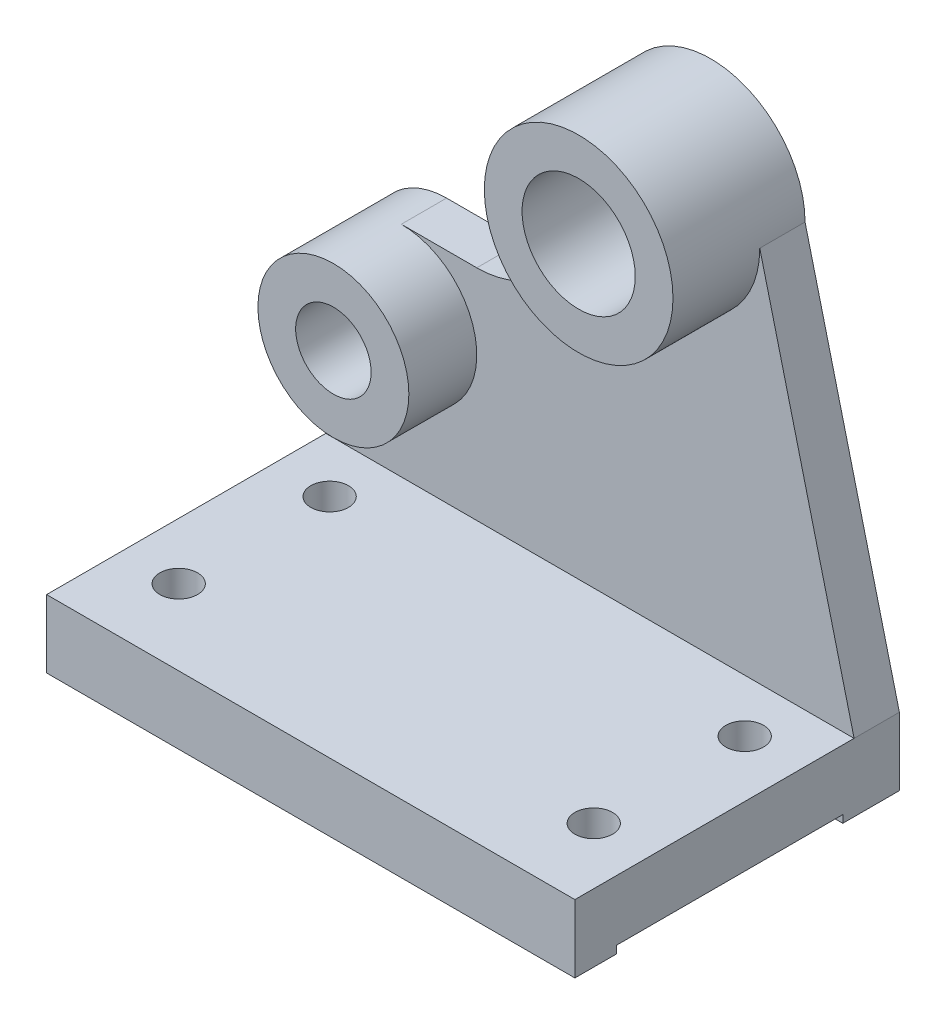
from build123d import *

# Parameters (mm, degrees)
SKETCH1_W           = 140
SKETCH1_H           = 18
BOSS_EXTRUDE1_DEPTH = 86
BOSS_EXTRUDE2_DEPTH = 12
SKETCH1_4_R         = 25
SKETCH1_4_R_2       = 15
BOSS_EXTRUDE3_DEPTH = 35
SKETCH1_5_R         = 20
SKETCH1_5_R_2       = 10
BOSS_EXTRUDE4_DEPTH = 30
SKETCH2_W           = 60
SKETCH2_H           = 2
CUT_EXTRUDE1_DEPTH  = 218.818731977
SKETCH3_R           = 5
CUT_EXTRUDE2_DEPTH  = 168.095780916


with BuildPart() as part:
    # Sketch1 → Boss-Extrude1 (new body)
    with BuildSketch(Plane.XY):
        with Locations((0, 9)):
            Rectangle(SKETCH1_W, SKETCH1_H)
    extrude(amount=BOSS_EXTRUDE1_DEPTH)

    # Sketch1_3 → Boss-Extrude2 (add)
    with BuildSketch(Plane.XY):
        with BuildLine():
            Line((-70, 56), (-70, 18))
            Line((-70, 18), (70, 18))
            Line((70, 18), (45, 118))
            ThreePointArc((45, 118), (20, 93), (-5, 118))
            Line((-5, 118), (-5, 101))
            ThreePointArc((-5, 101), (-12.32233047, 83.32233047), (-30, 76))
            Line((-30, 76), (-50, 76))
            ThreePointArc((-50, 76), (-35.857864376, 70.142135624), (-30, 56))
            ThreePointArc((-30, 56), (-50, 36), (-70, 56))
        make_face()
    extrude(amount=BOSS_EXTRUDE2_DEPTH)

    # Sketch1_4 → Boss-Extrude3 (add)
    with BuildSketch(Plane.XY):
        with Locations((20, 118)):
            Circle(SKETCH1_4_R)
        with Locations((20, 118)):
            Circle(SKETCH1_4_R_2, mode=Mode.SUBTRACT)
    extrude(amount=BOSS_EXTRUDE3_DEPTH)

    # Sketch1_5 → Boss-Extrude4 (add)
    with BuildSketch(Plane.XY):
        with Locations(Location((-50, 56, 0), (0, 0, 180))):
            Circle(SKETCH1_5_R)
        with Locations((-50, 56)):
            Circle(SKETCH1_5_R_2, mode=Mode.SUBTRACT)
    extrude(amount=BOSS_EXTRUDE4_DEPTH)

    # Sketch2 → Cut-Extrude1 (cut, through all)
    with BuildSketch(Plane(origin=(70, 0, 0), x_dir=(0, 0, -1), z_dir=(1, 0, 0))):
        with Locations((-45, 1)):
            Rectangle(SKETCH2_W, SKETCH2_H)
    extrude(amount=-CUT_EXTRUDE1_DEPTH, mode=Mode.SUBTRACT)

    # Sketch3 → Cut-Extrude2 (cut, through all)
    with BuildSketch(Plane(origin=(0, 18, 0), x_dir=(1, 0, 0), z_dir=(0, 1, 0))):
        with Locations(Location((-55, -66, 0), (0, 0, 180))):
            Circle(SKETCH3_R)
        with Locations(Location((-55, -26, 0), (0, 0, 180))):
            Circle(SKETCH3_R)
        with Locations(Location((55, -66, 0), (0, 0, 180))):
            Circle(SKETCH3_R)
        with Locations(Location((55, -26, 0), (0, 0, 180))):
            Circle(SKETCH3_R)
    extrude(amount=-CUT_EXTRUDE2_DEPTH, mode=Mode.SUBTRACT)


solid = part.part
